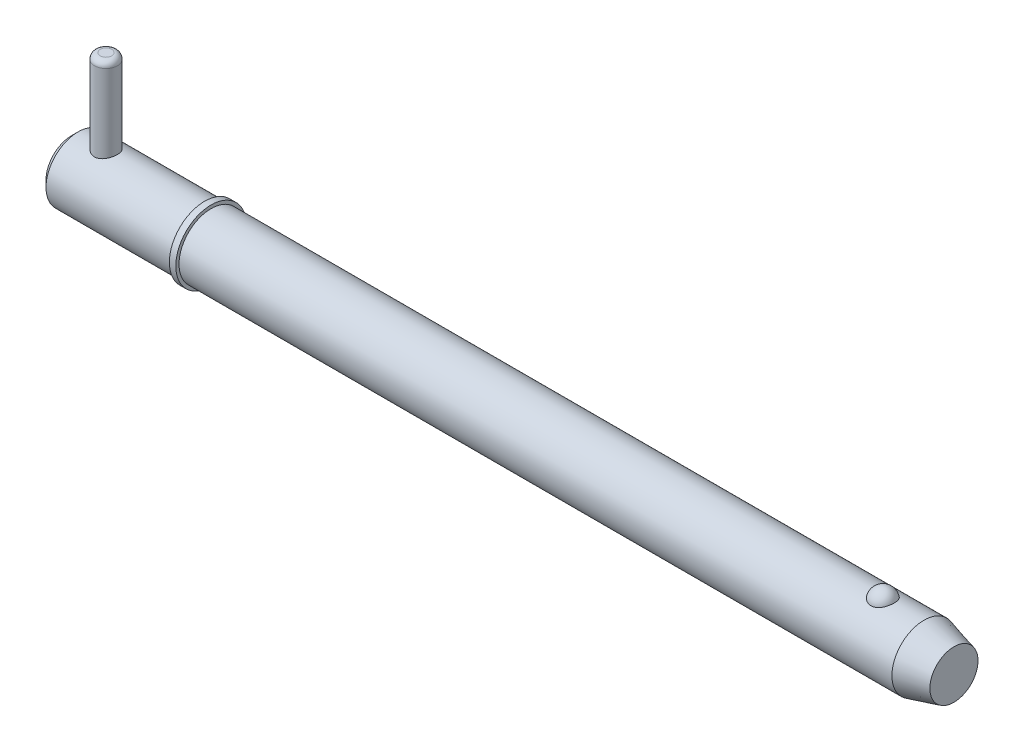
ISO-10303-21;
HEADER;
FILE_DESCRIPTION(('STEP AP214'),'2;1');
FILE_NAME('part.step','',(''),(''),'','','');
FILE_SCHEMA(('AUTOMOTIVE_DESIGN { 1 0 10303 214 1 1 1 1 }'));
ENDSEC;
DATA;
#1=APPLICATION_CONTEXT('core data for automotive mechanical design processes');
#2=APPLICATION_PROTOCOL_DEFINITION('international standard','automotive_design',2000,#1);
#3=PRODUCT_CONTEXT('',#1,'mechanical');
#4=PRODUCT('Part','Part','',(#3));
#5=PRODUCT_RELATED_PRODUCT_CATEGORY('part','',(#4));
#6=PRODUCT_DEFINITION_FORMATION('','',#4);
#7=PRODUCT_DEFINITION_CONTEXT('part definition',#1,'design');
#8=PRODUCT_DEFINITION('design','',#6,#7);
#9=PRODUCT_DEFINITION_SHAPE('','',#8);
#10=(LENGTH_UNIT() NAMED_UNIT(*) SI_UNIT(.MILLI.,.METRE.));
#11=(NAMED_UNIT(*) PLANE_ANGLE_UNIT() SI_UNIT($,.RADIAN.));
#12=(NAMED_UNIT(*) SI_UNIT($,.STERADIAN.) SOLID_ANGLE_UNIT());
#13=UNCERTAINTY_MEASURE_WITH_UNIT(LENGTH_MEASURE(1.E-05),#10,'distance_accuracy_value','');
#14=(GEOMETRIC_REPRESENTATION_CONTEXT(3) GLOBAL_UNCERTAINTY_ASSIGNED_CONTEXT((#13)) GLOBAL_UNIT_ASSIGNED_CONTEXT((#10,
#11,#12)) REPRESENTATION_CONTEXT('',''));
#15=CARTESIAN_POINT('',(0.,0.,0.));
#16=DIRECTION('',(0.,0.,1.));
#17=DIRECTION('',(1.,0.,0.));
#18=AXIS2_PLACEMENT_3D('',#15,#16,#17);
#19=CARTESIAN_POINT('',(5.94,19.845,0.));
#20=DIRECTION('',(0.,-1.,0.));
#21=DIRECTION('',(0.,0.,-1.));
#22=AXIS2_PLACEMENT_3D('',#19,#20,#21);
#23=CYLINDRICAL_SURFACE('',#22,1.98);
#24=CARTESIAN_POINT('',(5.94,-4.565,0.));
#25=DIRECTION('',(0.,1.,0.));
#26=DIRECTION('',(0.,0.,1.));
#27=AXIS2_PLACEMENT_3D('',#24,#25,#26);
#28=CIRCLE('',#27,1.98);
#29=CARTESIAN_POINT('',(5.94,-4.565,1.98));
#30=VERTEX_POINT('',#29);
#31=EDGE_CURVE('P0_E25',#30,#30,#28,.T.);
#32=ORIENTED_EDGE('',*,*,#31,.T.);
#33=EDGE_LOOP('',(#32));
#34=FACE_BOUND('',#33,.T.);
#35=CARTESIAN_POINT('',(5.94,18.855,0.));
#36=DIRECTION('',(0.,1.,0.));
#37=DIRECTION('',(0.,0.,1.));
#38=AXIS2_PLACEMENT_3D('',#35,#36,#37);
#39=CIRCLE('',#38,1.98);
#40=CARTESIAN_POINT('',(5.94,18.855,1.98));
#41=VERTEX_POINT('',#40);
#42=EDGE_CURVE('P0_E29',#41,#41,#39,.F.);
#43=ORIENTED_EDGE('',*,*,#42,.T.);
#44=EDGE_LOOP('',(#43));
#45=FACE_BOUND('',#44,.T.);
#46=ADVANCED_FACE('P0_F14',(#34,#45),#23,.T.);
#47=CARTESIAN_POINT('',(5.94,19.845,0.));
#48=DIRECTION('',(0.,1.,0.));
#49=DIRECTION('',(0.,0.,1.));
#50=AXIS2_PLACEMENT_3D('',#47,#48,#49);
#51=PLANE('',#50);
#52=CARTESIAN_POINT('',(5.94,19.845,0.));
#53=DIRECTION('',(0.,1.,0.));
#54=DIRECTION('',(0.,0.,1.));
#55=AXIS2_PLACEMENT_3D('',#52,#53,#54);
#56=CIRCLE('',#55,0.99);
#57=CARTESIAN_POINT('',(5.94,19.845,0.99));
#58=VERTEX_POINT('',#57);
#59=EDGE_CURVE('P0_E10',#58,#58,#56,.T.);
#60=ORIENTED_EDGE('',*,*,#59,.T.);
#61=EDGE_LOOP('',(#60));
#62=FACE_BOUND('',#61,.T.);
#63=ADVANCED_FACE('P0_F46',(#62),#51,.T.);
#64=CARTESIAN_POINT('',(5.94,-5.555,0.));
#65=DIRECTION('',(0.,1.,0.));
#66=DIRECTION('',(0.,0.,1.));
#67=AXIS2_PLACEMENT_3D('',#64,#65,#66);
#68=PLANE('',#67);
#69=CARTESIAN_POINT('',(5.94,-5.555,0.));
#70=DIRECTION('',(0.,1.,0.));
#71=DIRECTION('',(0.,0.,1.));
#72=AXIS2_PLACEMENT_3D('',#69,#70,#71);
#73=CIRCLE('',#72,0.99);
#74=CARTESIAN_POINT('',(5.94,-5.555,0.99));
#75=VERTEX_POINT('',#74);
#76=EDGE_CURVE('P0_E21',#75,#75,#73,.F.);
#77=ORIENTED_EDGE('',*,*,#76,.T.);
#78=EDGE_LOOP('',(#77));
#79=FACE_BOUND('',#78,.T.);
#80=ADVANCED_FACE('P0_F43',(#79),#68,.F.);
#81=CARTESIAN_POINT('',(5.94,-4.565,0.));
#82=DIRECTION('',(0.,1.,0.));
#83=DIRECTION('',(0.,0.,1.));
#84=AXIS2_PLACEMENT_3D('',#81,#82,#83);
#85=DEGENERATE_TOROIDAL_SURFACE('',#84,0.99,0.99,.T.);
#86=ORIENTED_EDGE('',*,*,#76,.F.);
#87=EDGE_LOOP('',(#86));
#88=FACE_BOUND('',#87,.T.);
#89=ORIENTED_EDGE('',*,*,#31,.F.);
#90=EDGE_LOOP('',(#89));
#91=FACE_BOUND('',#90,.T.);
#92=ADVANCED_FACE('P0_F38',(#88,#91),#85,.T.);
#93=CARTESIAN_POINT('',(5.94,18.855,0.));
#94=DIRECTION('',(0.,1.,0.));
#95=DIRECTION('',(0.,0.,1.));
#96=AXIS2_PLACEMENT_3D('',#93,#94,#95);
#97=DEGENERATE_TOROIDAL_SURFACE('',#96,0.99,0.99,.T.);
#98=ORIENTED_EDGE('',*,*,#42,.F.);
#99=EDGE_LOOP('',(#98));
#100=FACE_BOUND('',#99,.T.);
#101=ORIENTED_EDGE('',*,*,#59,.F.);
#102=EDGE_LOOP('',(#101));
#103=FACE_BOUND('',#102,.T.);
#104=ADVANCED_FACE('P0_F16',(#100,#103),#97,.T.);
#105=CLOSED_SHELL('',(#46,#63,#80,#92,#104));
#106=MANIFOLD_SOLID_BREP('P0_B1',#105);
#107=CARTESIAN_POINT('',(0.,0.,0.));
#108=DIRECTION('',(1.,0.,0.));
#109=DIRECTION('',(0.,0.,-1.));
#110=AXIS2_PLACEMENT_3D('',#107,#108,#109);
#111=CYLINDRICAL_SURFACE('',#110,5.555);
#112=CARTESIAN_POINT('',(147.517114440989,0.,0.));
#113=DIRECTION('',(1.,0.,0.));
#114=DIRECTION('',(0.,0.,-1.));
#115=AXIS2_PLACEMENT_3D('',#112,#113,#114);
#116=CIRCLE('',#115,5.555);
#117=CARTESIAN_POINT('',(147.517114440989,0.,-5.555));
#118=VERTEX_POINT('',#117);
#119=EDGE_CURVE('P1_E81',#118,#118,#116,.T.);
#120=ORIENTED_EDGE('',*,*,#119,.F.);
#121=EDGE_LOOP('',(#120));
#122=FACE_BOUND('',#121,.T.);
#123=CARTESIAN_POINT('',(24.13,0.,0.));
#124=DIRECTION('',(1.,0.,0.));
#125=DIRECTION('',(0.,0.,-1.));
#126=AXIS2_PLACEMENT_3D('',#123,#124,#125);
#127=CIRCLE('',#126,5.555);
#128=CARTESIAN_POINT('',(24.13,0.,-5.555));
#129=VERTEX_POINT('',#128);
#130=EDGE_CURVE('P1_E85',#129,#129,#127,.T.);
#131=ORIENTED_EDGE('',*,*,#130,.T.);
#132=EDGE_LOOP('',(#131));
#133=FACE_BOUND('',#132,.T.);
#134=CARTESIAN_POINT('',(140.398626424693,5.16741224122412,2.03859650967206));
#135=CARTESIAN_POINT('',(140.292949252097,5.16740893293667,2.03859990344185));
#136=CARTESIAN_POINT('',(140.18729894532,5.17079470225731,2.03008306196));
#137=CARTESIAN_POINT('',(139.979141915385,5.18392795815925,1.99630721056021));
#138=CARTESIAN_POINT('',(139.876634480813,5.19367399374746,1.97105201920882));
#139=CARTESIAN_POINT('',(139.677771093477,5.21839168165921,1.9046399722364));
#140=CARTESIAN_POINT('',(139.581406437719,5.23335573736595,1.8635062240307));
#141=CARTESIAN_POINT('',(139.397080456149,5.26688076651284,1.76652592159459));
#142=CARTESIAN_POINT('',(139.309120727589,5.28544242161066,1.71067657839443));
#143=CARTESIAN_POINT('',(139.141265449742,5.32479845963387,1.58399959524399));
#144=CARTESIAN_POINT('',(139.06166564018,5.34564089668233,1.51279545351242));
#145=CARTESIAN_POINT('',(138.91512901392,5.38697258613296,1.35828584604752));
#146=CARTESIAN_POINT('',(138.848194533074,5.40746177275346,1.27497815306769));
#147=CARTESIAN_POINT('',(138.72561039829,5.44694508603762,1.0944029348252));
#148=CARTESIAN_POINT('',(138.670598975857,5.46583143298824,0.996677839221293));
#149=CARTESIAN_POINT('',(138.576937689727,5.49908030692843,0.792961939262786));
#150=CARTESIAN_POINT('',(138.538289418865,5.513442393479,0.686970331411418));
#151=CARTESIAN_POINT('',(138.477680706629,5.53635851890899,0.468019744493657));
#152=CARTESIAN_POINT('',(138.455972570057,5.54482455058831,0.354981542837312));
#153=CARTESIAN_POINT('',(138.430636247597,5.55473324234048,0.12659586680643));
#154=CARTESIAN_POINT('',(138.427007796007,5.55617600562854,0.0112484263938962));
#155=CARTESIAN_POINT('',(138.437881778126,5.55189984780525,-0.218011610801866));
#156=CARTESIAN_POINT('',(138.452315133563,5.54620821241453,-0.331928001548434));
#157=CARTESIAN_POINT('',(138.498903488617,5.52828920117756,-0.555544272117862));
#158=CARTESIAN_POINT('',(138.531058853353,5.5160616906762,-0.665244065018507));
#159=CARTESIAN_POINT('',(138.612488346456,5.48630779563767,-0.877469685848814));
#160=CARTESIAN_POINT('',(138.661781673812,5.4687754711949,-0.979987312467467));
#161=CARTESIAN_POINT('',(138.776478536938,5.43024700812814,-1.17486975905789));
#162=CARTESIAN_POINT('',(138.841883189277,5.4092506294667,-1.26723387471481));
#163=CARTESIAN_POINT('',(138.987571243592,5.36600927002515,-1.4394013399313));
#164=CARTESIAN_POINT('',(139.067885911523,5.34376173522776,-1.51917763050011));
#165=CARTESIAN_POINT('',(139.241452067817,5.30057971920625,-1.66360338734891));
#166=CARTESIAN_POINT('',(139.334702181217,5.27964509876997,-1.72825445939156));
#167=CARTESIAN_POINT('',(139.529393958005,5.24205250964,-1.83909478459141));
#168=CARTESIAN_POINT('',(139.630590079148,5.22530519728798,-1.88568407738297));
#169=CARTESIAN_POINT('',(139.840155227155,5.1975091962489,-1.96100802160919));
#170=CARTESIAN_POINT('',(139.948521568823,5.1864583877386,-1.98974931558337));
#171=CARTESIAN_POINT('',(140.163498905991,5.17184410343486,-2.02742262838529));
#172=CARTESIAN_POINT('',(140.269925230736,5.1679328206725,-2.03727608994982));
#173=CARTESIAN_POINT('',(140.482992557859,5.16698995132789,-2.03966777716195));
#174=CARTESIAN_POINT('',(140.589633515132,5.16995704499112,-2.0322093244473));
#175=CARTESIAN_POINT('',(140.796773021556,5.18222383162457,-2.00071170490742));
#176=CARTESIAN_POINT('',(140.897359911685,5.19133213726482,-1.97717337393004));
#177=CARTESIAN_POINT('',(141.093014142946,5.21467637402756,-1.91475248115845));
#178=CARTESIAN_POINT('',(141.188081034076,5.22891272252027,-1.87586867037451));
#179=CARTESIAN_POINT('',(141.372371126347,5.26137066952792,-1.78282713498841));
#180=CARTESIAN_POINT('',(141.461419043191,5.27967329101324,-1.72835124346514));
#181=CARTESIAN_POINT('',(141.629288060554,5.3181741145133,-1.60597483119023));
#182=CARTESIAN_POINT('',(141.708106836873,5.33837274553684,-1.5380712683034));
#183=CARTESIAN_POINT('',(141.857515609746,5.37968287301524,-1.38688970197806));
#184=CARTESIAN_POINT('',(141.927505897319,5.40079011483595,-1.30301744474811));
#185=CARTESIAN_POINT('',(142.053012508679,5.44074401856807,-1.12458170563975));
#186=CARTESIAN_POINT('',(142.108526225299,5.45959027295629,-1.03001630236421));
#187=CARTESIAN_POINT('',(142.205550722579,5.49369849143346,-0.829439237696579));
#188=CARTESIAN_POINT('',(142.246548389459,5.50882422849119,-0.723155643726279));
#189=CARTESIAN_POINT('',(142.311125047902,5.53310911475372,-0.504772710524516));
#190=CARTESIAN_POINT('',(142.334703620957,5.54226812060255,-0.392673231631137));
#191=CARTESIAN_POINT('',(142.364013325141,5.55370358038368,-0.165459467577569));
#192=CARTESIAN_POINT('',(142.369688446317,5.55595843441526,-0.0503368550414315));
#193=CARTESIAN_POINT('',(142.362916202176,5.55329317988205,0.179288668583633));
#194=CARTESIAN_POINT('',(142.350469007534,5.54837313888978,0.293791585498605));
#195=CARTESIAN_POINT('',(142.307779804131,5.53189037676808,0.51852641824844));
#196=CARTESIAN_POINT('',(142.277598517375,5.5203503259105,0.62877154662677));
#197=CARTESIAN_POINT('',(142.200096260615,5.49182453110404,0.842318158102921));
#198=CARTESIAN_POINT('',(142.152774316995,5.47483847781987,0.94561924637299));
#199=CARTESIAN_POINT('',(142.041720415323,5.43710633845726,1.14281571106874));
#200=CARTESIAN_POINT('',(141.977921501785,5.41634501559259,1.23667048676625));
#201=CARTESIAN_POINT('',(141.835357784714,5.37334572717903,1.4118524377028));
#202=CARTESIAN_POINT('',(141.75659323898,5.35110778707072,1.49317982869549));
#203=CARTESIAN_POINT('',(141.586423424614,5.30779474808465,1.64049162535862));
#204=CARTESIAN_POINT('',(141.49510026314,5.2867132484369,1.70656877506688));
#205=CARTESIAN_POINT('',(141.301739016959,5.2480485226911,1.82201372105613));
#206=CARTESIAN_POINT('',(141.199700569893,5.23046541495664,1.87138095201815));
#207=CARTESIAN_POINT('',(140.983618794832,5.20042692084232,1.95335298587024));
#208=CARTESIAN_POINT('',(140.869260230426,5.18820192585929,1.98521734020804));
#209=CARTESIAN_POINT('',(140.636130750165,5.17169804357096,2.02783294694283));
#210=CARTESIAN_POINT('',(140.517361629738,5.16741595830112,2.03859269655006));
#211=CARTESIAN_POINT('',(140.398626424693,5.16741224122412,2.03859650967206));
#212=B_SPLINE_CURVE_WITH_KNOTS('',3,(#134,#135,#136,#137,#138,#139,#140,#141,#142,#143,#144,
#145,#146,#147,#148,#149,#150,#151,#152,#153,#154,#155,#156,#157,#158,#159,#160,#161,#162,#163,
#164,#165,#166,#167,#168,#169,#170,#171,#172,#173,#174,#175,#176,#177,#178,#179,#180,#181,#182,
#183,#184,#185,#186,#187,#188,#189,#190,#191,#192,#193,#194,#195,#196,#197,#198,#199,#200,#201,
#202,#203,#204,#205,#206,#207,#208,#209,#210,#211),.UNSPECIFIED.,.T.,.F.,(4,2,2,2,2,2,2,2,2,2,2,
2,2,2,2,2,2,2,2,2,2,2,2,2,2,2,2,2,2,2,2,2,2,2,2,2,2,2,4),(0.,0.316595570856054,
0.633118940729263,0.94918341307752,1.26530783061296,1.59030762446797,1.91536729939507,
2.25495824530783,2.59458224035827,2.93917283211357,3.28375835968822,3.62703002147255,
3.97030875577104,4.31397329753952,4.657661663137,5.00207904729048,5.34645984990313,
5.68270547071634,6.01882587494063,6.33808403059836,6.65728093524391,6.9669637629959,
7.27667180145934,7.59321535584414,7.90983070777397,8.24210387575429,8.57443684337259,
8.91755896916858,9.26068933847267,9.60489211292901,9.94909164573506,10.2921194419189,
10.6351667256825,10.9796305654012,11.3240884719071,11.6663928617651,12.0087088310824,
12.3645679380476,12.7202837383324),.UNSPECIFIED.);
#213=CARTESIAN_POINT('',(140.398626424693,5.16741224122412,2.03859650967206));
#214=VERTEX_POINT('',#213);
#215=EDGE_CURVE('P1_E35',#214,#214,#212,.T.);
#216=ORIENTED_EDGE('',*,*,#215,.T.);
#217=EDGE_LOOP('',(#216));
#218=FACE_BOUND('',#217,.T.);
#219=ADVANCED_FACE('P1_F13',(#122,#133,#218),#111,.T.);
#220=CARTESIAN_POINT('',(0.,0.,0.));
#221=DIRECTION('',(-1.,0.,0.));
#222=DIRECTION('',(0.,0.,1.));
#223=AXIS2_PLACEMENT_3D('',#220,#221,#222);
#224=PLANE('',#223);
#225=CARTESIAN_POINT('',(0.,0.,0.));
#226=DIRECTION('',(1.,0.,0.));
#227=DIRECTION('',(0.,0.,-1.));
#228=AXIS2_PLACEMENT_3D('',#225,#226,#227);
#229=CIRCLE('',#228,4.444);
#230=CARTESIAN_POINT('',(0.,0.,-4.444));
#231=VERTEX_POINT('',#230);
#232=EDGE_CURVE('P1_E9',#231,#231,#229,.T.);
#233=ORIENTED_EDGE('',*,*,#232,.F.);
#234=EDGE_LOOP('',(#233));
#235=FACE_BOUND('',#234,.T.);
#236=ADVANCED_FACE('P1_F15',(#235),#224,.T.);
#237=CARTESIAN_POINT('',(1.111,0.,0.));
#238=DIRECTION('',(1.,0.,0.));
#239=DIRECTION('',(0.,0.,-1.));
#240=AXIS2_PLACEMENT_3D('',#237,#238,#239);
#241=CONICAL_SURFACE('',#240,5.555,0.78539816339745);
#242=ORIENTED_EDGE('',*,*,#232,.T.);
#243=EDGE_LOOP('',(#242));
#244=FACE_BOUND('',#243,.T.);
#245=CARTESIAN_POINT('',(1.111,0.,0.));
#246=DIRECTION('',(1.,0.,0.));
#247=DIRECTION('',(0.,0.,-1.));
#248=AXIS2_PLACEMENT_3D('',#245,#246,#247);
#249=CIRCLE('',#248,5.555);
#250=CARTESIAN_POINT('',(1.111,0.,-5.555));
#251=VERTEX_POINT('',#250);
#252=EDGE_CURVE('P1_E26',#251,#251,#249,.T.);
#253=ORIENTED_EDGE('',*,*,#252,.F.);
#254=EDGE_LOOP('',(#253));
#255=FACE_BOUND('',#254,.T.);
#256=ADVANCED_FACE('P1_F77',(#244,#255),#241,.T.);
#257=CARTESIAN_POINT('',(0.,0.,0.));
#258=DIRECTION('',(1.,0.,0.));
#259=DIRECTION('',(0.,0.,-1.));
#260=AXIS2_PLACEMENT_3D('',#257,#258,#259);
#261=CYLINDRICAL_SURFACE('',#260,5.555);
#262=CARTESIAN_POINT('',(5.94,-5.19014691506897,1.98));
#263=CARTESIAN_POINT('',(5.83264687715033,-5.19014494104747,1.98000226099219));
#264=CARTESIAN_POINT('',(5.7253094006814,-5.19351395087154,1.97123988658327));
#265=CARTESIAN_POINT('',(5.51384517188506,-5.20654291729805,1.93656219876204));
#266=CARTESIAN_POINT('',(5.40971858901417,-5.21620320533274,1.91064598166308));
#267=CARTESIAN_POINT('',(5.20778082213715,-5.24058443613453,1.84271148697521));
#268=CARTESIAN_POINT('',(5.10995634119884,-5.25529427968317,1.80072850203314));
#269=CARTESIAN_POINT('',(4.92270352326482,-5.28810012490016,1.70197537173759));
#270=CARTESIAN_POINT('',(4.83327743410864,-5.3061970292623,1.64520128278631));
#271=CARTESIAN_POINT('',(4.66135184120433,-5.34464714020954,1.51575187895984));
#272=CARTESIAN_POINT('',(4.57928277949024,-5.36506222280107,1.44252311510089));
#273=CARTESIAN_POINT('',(4.42829115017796,-5.40532920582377,1.28342047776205));
#274=CARTESIAN_POINT('',(4.35937105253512,-5.42518099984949,1.19754423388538));
#275=CARTESIAN_POINT('',(4.23461605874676,-5.46281133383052,1.01237205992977));
#276=CARTESIAN_POINT('',(4.17924129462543,-5.48050875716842,0.912748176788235));
#277=CARTESIAN_POINT('',(4.0862117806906,-5.51109938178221,0.70485824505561));
#278=CARTESIAN_POINT('',(4.0485515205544,-5.52399407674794,0.596594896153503));
#279=CARTESIAN_POINT('',(3.99350662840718,-5.54308759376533,0.379019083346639));
#280=CARTESIAN_POINT('',(3.97538263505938,-5.54952987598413,0.269915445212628));
#281=CARTESIAN_POINT('',(3.95756405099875,-5.55586205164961,0.0500378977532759));
#282=CARTESIAN_POINT('',(3.95786404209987,-5.55575387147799,-0.060735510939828));
#283=CARTESIAN_POINT('',(3.97643665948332,-5.54915684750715,-0.275539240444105));
#284=CARTESIAN_POINT('',(3.99390415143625,-5.54295384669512,-0.379649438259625));
#285=CARTESIAN_POINT('',(4.0449721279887,-5.52523170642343,-0.583350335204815));
#286=CARTESIAN_POINT('',(4.07857373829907,-5.51371219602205,-0.682940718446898));
#287=CARTESIAN_POINT('',(4.16137312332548,-5.4863099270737,-0.876423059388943));
#288=CARTESIAN_POINT('',(4.2107826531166,-5.47036834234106,-0.970215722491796));
#289=CARTESIAN_POINT('',(4.32361427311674,-5.43575653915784,-1.1484017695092));
#290=CARTESIAN_POINT('',(4.38704062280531,-5.41708549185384,-1.23279228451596));
#291=CARTESIAN_POINT('',(4.53006791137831,-5.37778429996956,-1.39454579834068));
#292=CARTESIAN_POINT('',(4.61035105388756,-5.35710277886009,-1.4712940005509));
#293=CARTESIAN_POINT('',(4.78279835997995,-5.31692766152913,-1.6104545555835));
#294=CARTESIAN_POINT('',(4.874964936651,-5.29743430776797,-1.67286398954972));
#295=CARTESIAN_POINT('',(5.07076688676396,-5.26153775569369,-1.78259698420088));
#296=CARTESIAN_POINT('',(5.17458163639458,-5.24519780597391,-1.8296227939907));
#297=CARTESIAN_POINT('',(5.38938990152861,-5.21818744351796,-1.90530278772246));
#298=CARTESIAN_POINT('',(5.50037985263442,-5.20751423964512,-1.93396601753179));
#299=CARTESIAN_POINT('',(5.72036376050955,-5.19369176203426,-1.97077654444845));
#300=CARTESIAN_POINT('',(5.82917370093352,-5.19018851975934,-1.97989015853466));
#301=CARTESIAN_POINT('',(6.04680100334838,-5.19010609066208,-1.98010779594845));
#302=CARTESIAN_POINT('',(6.15561835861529,-5.19352540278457,-1.97121572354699));
#303=CARTESIAN_POINT('',(6.36548036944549,-5.20654623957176,-1.93654727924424));
#304=CARTESIAN_POINT('',(6.46666051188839,-5.21588705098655,-1.91148218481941));
#305=CARTESIAN_POINT('',(6.66334537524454,-5.23939939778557,-1.84605494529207));
#306=CARTESIAN_POINT('',(6.75884899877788,-5.25357186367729,-1.8056898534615));
#307=CARTESIAN_POINT('',(6.94517989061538,-5.28576258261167,-1.70921153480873));
#308=CARTESIAN_POINT('',(7.03572661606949,-5.30389804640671,-1.65259670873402));
#309=CARTESIAN_POINT('',(7.20638087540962,-5.34176077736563,-1.52577523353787));
#310=CARTESIAN_POINT('',(7.28648490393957,-5.36148857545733,-1.45556404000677));
#311=CARTESIAN_POINT('',(7.43864697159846,-5.40165494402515,-1.2988614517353));
#312=CARTESIAN_POINT('',(7.50999887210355,-5.42207106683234,-1.21167640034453));
#313=CARTESIAN_POINT('',(7.63712639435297,-5.46023601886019,-1.026066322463));
#314=CARTESIAN_POINT('',(7.69290228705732,-5.47798489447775,-0.927641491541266));
#315=CARTESIAN_POINT('',(7.78684673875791,-5.50876590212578,-0.722633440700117));
#316=CARTESIAN_POINT('',(7.82510508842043,-5.52182201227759,-0.616095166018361));
#317=CARTESIAN_POINT('',(7.88297051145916,-5.54184206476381,-0.397530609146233));
#318=CARTESIAN_POINT('',(7.90258540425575,-5.5488085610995,-0.285506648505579));
#319=CARTESIAN_POINT('',(7.9218262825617,-5.55564472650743,-0.065566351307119));
#320=CARTESIAN_POINT('',(7.92245987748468,-5.55587212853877,0.0422515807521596));
#321=CARTESIAN_POINT('',(7.90626329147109,-5.55011340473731,0.256387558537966));
#322=CARTESIAN_POINT('',(7.88943488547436,-5.54412791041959,0.362705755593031));
#323=CARTESIAN_POINT('',(7.83948457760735,-5.52676548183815,0.568649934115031));
#324=CARTESIAN_POINT('',(7.8067003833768,-5.51550046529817,0.668367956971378));
#325=CARTESIAN_POINT('',(7.72609369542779,-5.48874437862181,0.860911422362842));
#326=CARTESIAN_POINT('',(7.67826838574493,-5.47325251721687,0.953735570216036));
#327=CARTESIAN_POINT('',(7.56675024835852,-5.43884382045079,1.13391068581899));
#328=CARTESIAN_POINT('',(7.50249968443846,-5.41981485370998,1.22089468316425));
#329=CARTESIAN_POINT('',(7.36086495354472,-5.38069275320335,1.38316665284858));
#330=CARTESIAN_POINT('',(7.28347630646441,-5.36059925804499,1.45845061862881));
#331=CARTESIAN_POINT('',(7.11347587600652,-5.32048380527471,1.59876646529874));
#332=CARTESIAN_POINT('',(7.02032386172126,-5.30050854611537,1.66315951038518));
#333=CARTESIAN_POINT('',(6.82388804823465,-5.26398994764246,1.77536801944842));
#334=CARTESIAN_POINT('',(6.7206049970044,-5.24744635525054,1.82318470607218));
#335=CARTESIAN_POINT('',(6.50639706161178,-5.21987969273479,1.90068230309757));
#336=CARTESIAN_POINT('',(6.3954529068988,-5.20887116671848,1.93031547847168));
#337=CARTESIAN_POINT('',(6.16966522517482,-5.19400760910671,1.96996824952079));
#338=CARTESIAN_POINT('',(6.05482366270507,-5.19014902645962,1.97999758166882));
#339=CARTESIAN_POINT('',(5.94,-5.19014691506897,1.98));
#340=B_SPLINE_CURVE_WITH_KNOTS('',3,(#262,#263,#264,#265,#266,#267,#268,#269,#270,#271,#272,
#273,#274,#275,#276,#277,#278,#279,#280,#281,#282,#283,#284,#285,#286,#287,#288,#289,#290,#291,
#292,#293,#294,#295,#296,#297,#298,#299,#300,#301,#302,#303,#304,#305,#306,#307,#308,#309,#310,
#311,#312,#313,#314,#315,#316,#317,#318,#319,#320,#321,#322,#323,#324,#325,#326,#327,#328,#329,
#330,#331,#332,#333,#334,#335,#336,#337,#338,#339),.UNSPECIFIED.,.T.,.F.,(4,2,2,2,2,2,2,2,2,2,2,
2,2,2,2,2,2,2,2,2,2,2,2,2,2,2,2,2,2,2,2,2,2,2,2,2,2,2,4),(0.,0.321632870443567,
0.643282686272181,0.964229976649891,1.28526292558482,1.61937087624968,1.9535415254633,
2.29784481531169,2.64204093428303,2.97269632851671,3.30325448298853,3.61901541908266,
3.93479838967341,4.25500220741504,4.57530346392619,4.91268648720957,5.25013812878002,
5.59378026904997,5.93725299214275,6.26331481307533,6.58930593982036,6.90185604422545,
7.21446637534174,7.53801472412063,7.86167140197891,8.20353561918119,8.54539388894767,
8.88547970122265,9.22542281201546,9.54728637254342,9.86911722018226,10.1844146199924,
10.4997710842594,10.827730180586,11.1558013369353,11.499115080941,11.8424034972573,
12.1865892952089,12.5306041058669),.UNSPECIFIED.);
#341=CARTESIAN_POINT('',(5.94,-5.19014691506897,1.98));
#342=VERTEX_POINT('',#341);
#343=EDGE_CURVE('P1_E17',#342,#342,#340,.T.);
#344=ORIENTED_EDGE('',*,*,#343,.F.);
#345=EDGE_LOOP('',(#344));
#346=FACE_BOUND('',#345,.T.);
#347=CARTESIAN_POINT('',(5.94,5.19014691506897,1.98));
#348=CARTESIAN_POINT('',(6.04735312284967,5.19014494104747,1.98000226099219));
#349=CARTESIAN_POINT('',(6.1546905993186,5.19351395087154,1.97123988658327));
#350=CARTESIAN_POINT('',(6.36615482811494,5.20654291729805,1.93656219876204));
#351=CARTESIAN_POINT('',(6.47028141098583,5.21620320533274,1.91064598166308));
#352=CARTESIAN_POINT('',(6.67221917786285,5.24058443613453,1.84271148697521));
#353=CARTESIAN_POINT('',(6.77004365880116,5.25529427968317,1.80072850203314));
#354=CARTESIAN_POINT('',(6.95729647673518,5.28810012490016,1.70197537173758));
#355=CARTESIAN_POINT('',(7.04672256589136,5.3061970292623,1.64520128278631));
#356=CARTESIAN_POINT('',(7.21864815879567,5.34464714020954,1.51575187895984));
#357=CARTESIAN_POINT('',(7.30071722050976,5.36506222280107,1.44252311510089));
#358=CARTESIAN_POINT('',(7.45170884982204,5.40532920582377,1.28342047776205));
#359=CARTESIAN_POINT('',(7.52062894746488,5.42518099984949,1.19754423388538));
#360=CARTESIAN_POINT('',(7.64538394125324,5.46281133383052,1.01237205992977));
#361=CARTESIAN_POINT('',(7.70075870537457,5.48050875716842,0.912748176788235));
#362=CARTESIAN_POINT('',(7.7937882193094,5.51109938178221,0.704858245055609));
#363=CARTESIAN_POINT('',(7.8314484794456,5.52399407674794,0.596594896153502));
#364=CARTESIAN_POINT('',(7.88649337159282,5.54308759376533,0.379019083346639));
#365=CARTESIAN_POINT('',(7.90461736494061,5.54952987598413,0.269915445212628));
#366=CARTESIAN_POINT('',(7.92243594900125,5.55586205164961,0.0500378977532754));
#367=CARTESIAN_POINT('',(7.92213595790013,5.55575387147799,-0.0607355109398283));
#368=CARTESIAN_POINT('',(7.90356334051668,5.54915684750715,-0.275539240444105));
#369=CARTESIAN_POINT('',(7.88609584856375,5.54295384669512,-0.379649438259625));
#370=CARTESIAN_POINT('',(7.8350278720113,5.52523170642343,-0.583350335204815));
#371=CARTESIAN_POINT('',(7.80142626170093,5.51371219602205,-0.682940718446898));
#372=CARTESIAN_POINT('',(7.71862687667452,5.4863099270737,-0.876423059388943));
#373=CARTESIAN_POINT('',(7.6692173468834,5.47036834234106,-0.970215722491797));
#374=CARTESIAN_POINT('',(7.55638572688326,5.43575653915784,-1.1484017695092));
#375=CARTESIAN_POINT('',(7.49295937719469,5.41708549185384,-1.23279228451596));
#376=CARTESIAN_POINT('',(7.34993208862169,5.37778429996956,-1.39454579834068));
#377=CARTESIAN_POINT('',(7.26964894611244,5.35710277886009,-1.4712940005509));
#378=CARTESIAN_POINT('',(7.09720164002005,5.31692766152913,-1.6104545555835));
#379=CARTESIAN_POINT('',(7.00503506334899,5.29743430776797,-1.67286398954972));
#380=CARTESIAN_POINT('',(6.80923311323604,5.26153775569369,-1.78259698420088));
#381=CARTESIAN_POINT('',(6.70541836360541,5.24519780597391,-1.8296227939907));
#382=CARTESIAN_POINT('',(6.49061009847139,5.21818744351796,-1.90530278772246));
#383=CARTESIAN_POINT('',(6.37962014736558,5.20751423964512,-1.93396601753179));
#384=CARTESIAN_POINT('',(6.15963623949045,5.19369176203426,-1.97077654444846));
#385=CARTESIAN_POINT('',(6.05082629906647,5.19018851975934,-1.97989015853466));
#386=CARTESIAN_POINT('',(5.83319899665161,5.19010609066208,-1.98010779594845));
#387=CARTESIAN_POINT('',(5.7243816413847,5.19352540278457,-1.97121572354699));
#388=CARTESIAN_POINT('',(5.5145196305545,5.20654623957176,-1.93654727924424));
#389=CARTESIAN_POINT('',(5.4133394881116,5.21588705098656,-1.91148218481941));
#390=CARTESIAN_POINT('',(5.21665462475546,5.23939939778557,-1.84605494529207));
#391=CARTESIAN_POINT('',(5.12115100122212,5.25357186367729,-1.8056898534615));
#392=CARTESIAN_POINT('',(4.93482010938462,5.28576258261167,-1.70921153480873));
#393=CARTESIAN_POINT('',(4.84427338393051,5.30389804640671,-1.65259670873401));
#394=CARTESIAN_POINT('',(4.67361912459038,5.34176077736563,-1.52577523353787));
#395=CARTESIAN_POINT('',(4.59351509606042,5.36148857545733,-1.45556404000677));
#396=CARTESIAN_POINT('',(4.44135302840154,5.40165494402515,-1.2988614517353));
#397=CARTESIAN_POINT('',(4.37000112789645,5.42207106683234,-1.21167640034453));
#398=CARTESIAN_POINT('',(4.24287360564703,5.46023601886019,-1.026066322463));
#399=CARTESIAN_POINT('',(4.18709771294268,5.47798489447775,-0.927641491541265));
#400=CARTESIAN_POINT('',(4.09315326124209,5.50876590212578,-0.722633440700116));
#401=CARTESIAN_POINT('',(4.05489491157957,5.52182201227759,-0.61609516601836));
#402=CARTESIAN_POINT('',(3.99702948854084,5.54184206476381,-0.397530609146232));
#403=CARTESIAN_POINT('',(3.97741459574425,5.5488085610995,-0.285506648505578));
#404=CARTESIAN_POINT('',(3.9581737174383,5.55564472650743,-0.0655663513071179));
#405=CARTESIAN_POINT('',(3.95754012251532,5.55587212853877,0.0422515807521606));
#406=CARTESIAN_POINT('',(3.97373670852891,5.55011340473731,0.256387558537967));
#407=CARTESIAN_POINT('',(3.99056511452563,5.54412791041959,0.362705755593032));
#408=CARTESIAN_POINT('',(4.04051542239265,5.52676548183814,0.568649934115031));
#409=CARTESIAN_POINT('',(4.07329961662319,5.51550046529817,0.668367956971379));
#410=CARTESIAN_POINT('',(4.15390630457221,5.48874437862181,0.860911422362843));
#411=CARTESIAN_POINT('',(4.20173161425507,5.47325251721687,0.953735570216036));
#412=CARTESIAN_POINT('',(4.31324975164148,5.43884382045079,1.13391068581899));
#413=CARTESIAN_POINT('',(4.37750031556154,5.41981485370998,1.22089468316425));
#414=CARTESIAN_POINT('',(4.51913504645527,5.38069275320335,1.38316665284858));
#415=CARTESIAN_POINT('',(4.59652369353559,5.36059925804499,1.45845061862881));
#416=CARTESIAN_POINT('',(4.76652412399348,5.32048380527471,1.59876646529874));
#417=CARTESIAN_POINT('',(4.85967613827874,5.30050854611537,1.66315951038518));
#418=CARTESIAN_POINT('',(5.05611195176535,5.26398994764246,1.77536801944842));
#419=CARTESIAN_POINT('',(5.1593950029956,5.24744635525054,1.82318470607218));
#420=CARTESIAN_POINT('',(5.37360293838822,5.21987969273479,1.90068230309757));
#421=CARTESIAN_POINT('',(5.4845470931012,5.20887116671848,1.93031547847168));
#422=CARTESIAN_POINT('',(5.71033477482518,5.19400760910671,1.96996824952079));
#423=CARTESIAN_POINT('',(5.82517633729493,5.19014902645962,1.97999758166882));
#424=CARTESIAN_POINT('',(5.94,5.19014691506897,1.98));
#425=B_SPLINE_CURVE_WITH_KNOTS('',3,(#347,#348,#349,#350,#351,#352,#353,#354,#355,#356,#357,
#358,#359,#360,#361,#362,#363,#364,#365,#366,#367,#368,#369,#370,#371,#372,#373,#374,#375,#376,
#377,#378,#379,#380,#381,#382,#383,#384,#385,#386,#387,#388,#389,#390,#391,#392,#393,#394,#395,
#396,#397,#398,#399,#400,#401,#402,#403,#404,#405,#406,#407,#408,#409,#410,#411,#412,#413,#414,
#415,#416,#417,#418,#419,#420,#421,#422,#423,#424),.UNSPECIFIED.,.T.,.F.,(4,2,2,2,2,2,2,2,2,2,2,
2,2,2,2,2,2,2,2,2,2,2,2,2,2,2,2,2,2,2,2,2,2,2,2,2,2,2,4),(0.,0.321632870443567,
0.643282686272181,0.964229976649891,1.28526292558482,1.61937087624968,1.9535415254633,
2.29784481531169,2.64204093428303,2.97269632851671,3.30325448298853,3.61901541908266,
3.93479838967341,4.25500220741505,4.57530346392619,4.91268648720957,5.25013812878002,
5.59378026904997,5.93725299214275,6.26331481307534,6.58930593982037,6.90185604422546,
7.21446637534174,7.53801472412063,7.86167140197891,8.20353561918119,8.54539388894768,
8.88547970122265,9.22542281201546,9.54728637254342,9.86911722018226,10.1844146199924,
10.4997710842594,10.827730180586,11.1558013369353,11.499115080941,11.8424034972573,
12.1865892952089,12.5306041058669),.UNSPECIFIED.);
#426=CARTESIAN_POINT('',(5.94,5.19014691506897,1.98));
#427=VERTEX_POINT('',#426);
#428=EDGE_CURVE('P1_E43',#427,#427,#425,.T.);
#429=ORIENTED_EDGE('',*,*,#428,.F.);
#430=EDGE_LOOP('',(#429));
#431=FACE_BOUND('',#430,.T.);
#432=ORIENTED_EDGE('',*,*,#252,.T.);
#433=EDGE_LOOP('',(#432));
#434=FACE_BOUND('',#433,.T.);
#435=CARTESIAN_POINT('',(23.019,0.,0.));
#436=DIRECTION('',(1.,0.,0.));
#437=DIRECTION('',(0.,0.,-1.));
#438=AXIS2_PLACEMENT_3D('',#435,#436,#437);
#439=CIRCLE('',#438,5.555);
#440=CARTESIAN_POINT('',(23.019,0.,-5.555));
#441=VERTEX_POINT('',#440);
#442=EDGE_CURVE('P1_E31',#441,#441,#439,.T.);
#443=ORIENTED_EDGE('',*,*,#442,.F.);
#444=EDGE_LOOP('',(#443));
#445=FACE_BOUND('',#444,.T.);
#446=ADVANCED_FACE('P1_F103',(#346,#431,#434,#445),#261,.T.);
#447=CARTESIAN_POINT('',(23.019,5.555,0.));
#448=DIRECTION('',(-1.,0.,0.));
#449=DIRECTION('',(0.,0.,1.));
#450=AXIS2_PLACEMENT_3D('',#447,#448,#449);
#451=PLANE('',#450);
#452=ORIENTED_EDGE('',*,*,#442,.T.);
#453=EDGE_LOOP('',(#452));
#454=FACE_BOUND('',#453,.T.);
#455=CARTESIAN_POINT('',(23.019,0.,0.));
#456=DIRECTION('',(1.,0.,0.));
#457=DIRECTION('',(0.,0.,-1.));
#458=AXIS2_PLACEMENT_3D('',#455,#456,#457);
#459=CIRCLE('',#458,6.1105);
#460=CARTESIAN_POINT('',(23.019,0.,-6.1105));
#461=VERTEX_POINT('',#460);
#462=EDGE_CURVE('P1_E91',#461,#461,#459,.T.);
#463=ORIENTED_EDGE('',*,*,#462,.F.);
#464=EDGE_LOOP('',(#463));
#465=FACE_BOUND('',#464,.T.);
#466=ADVANCED_FACE('P1_F100',(#454,#465),#451,.T.);
#467=CARTESIAN_POINT('',(0.,0.,0.));
#468=DIRECTION('',(1.,0.,0.));
#469=DIRECTION('',(0.,0.,-1.));
#470=AXIS2_PLACEMENT_3D('',#467,#468,#469);
#471=CYLINDRICAL_SURFACE('',#470,6.1105);
#472=ORIENTED_EDGE('',*,*,#462,.T.);
#473=EDGE_LOOP('',(#472));
#474=FACE_BOUND('',#473,.T.);
#475=CARTESIAN_POINT('',(24.13,0.,0.));
#476=DIRECTION('',(1.,0.,0.));
#477=DIRECTION('',(0.,0.,-1.));
#478=AXIS2_PLACEMENT_3D('',#475,#476,#477);
#479=CIRCLE('',#478,6.1105);
#480=CARTESIAN_POINT('',(24.13,0.,-6.1105));
#481=VERTEX_POINT('',#480);
#482=EDGE_CURVE('P1_E88',#481,#481,#479,.T.);
#483=ORIENTED_EDGE('',*,*,#482,.F.);
#484=EDGE_LOOP('',(#483));
#485=FACE_BOUND('',#484,.T.);
#486=ADVANCED_FACE('P1_F68',(#474,#485),#471,.T.);
#487=CARTESIAN_POINT('',(24.13,6.1105,0.));
#488=DIRECTION('',(1.,0.,0.));
#489=DIRECTION('',(0.,0.,-1.));
#490=AXIS2_PLACEMENT_3D('',#487,#488,#489);
#491=PLANE('',#490);
#492=ORIENTED_EDGE('',*,*,#482,.T.);
#493=EDGE_LOOP('',(#492));
#494=FACE_BOUND('',#493,.T.);
#495=ORIENTED_EDGE('',*,*,#130,.F.);
#496=EDGE_LOOP('',(#495));
#497=FACE_BOUND('',#496,.T.);
#498=ADVANCED_FACE('P1_F62',(#494,#497),#491,.T.);
#499=CARTESIAN_POINT('',(152.7,0.,0.));
#500=DIRECTION('',(-1.,0.,0.));
#501=DIRECTION('',(0.,0.,1.));
#502=AXIS2_PLACEMENT_3D('',#499,#500,#501);
#503=CONICAL_SURFACE('',#502,4.16625000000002,0.261799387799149);
#504=ORIENTED_EDGE('',*,*,#119,.T.);
#505=EDGE_LOOP('',(#504));
#506=FACE_BOUND('',#505,.T.);
#507=CARTESIAN_POINT('',(152.7,0.,0.));
#508=DIRECTION('',(1.,0.,0.));
#509=DIRECTION('',(0.,0.,-1.));
#510=AXIS2_PLACEMENT_3D('',#507,#508,#509);
#511=CIRCLE('',#510,4.16625000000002);
#512=CARTESIAN_POINT('',(152.7,0.,-4.16625000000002));
#513=VERTEX_POINT('',#512);
#514=EDGE_CURVE('P1_E42',#513,#513,#511,.T.);
#515=ORIENTED_EDGE('',*,*,#514,.F.);
#516=EDGE_LOOP('',(#515));
#517=FACE_BOUND('',#516,.T.);
#518=ADVANCED_FACE('P1_F59',(#506,#517),#503,.T.);
#519=CARTESIAN_POINT('',(152.7,4.16625000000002,0.));
#520=DIRECTION('',(1.,0.,0.));
#521=DIRECTION('',(0.,0.,-1.));
#522=AXIS2_PLACEMENT_3D('',#519,#520,#521);
#523=PLANE('',#522);
#524=ORIENTED_EDGE('',*,*,#514,.T.);
#525=EDGE_LOOP('',(#524));
#526=FACE_BOUND('',#525,.T.);
#527=ADVANCED_FACE('P1_F55',(#526),#523,.T.);
#528=CARTESIAN_POINT('',(140.398626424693,4.9995,0.));
#529=DIRECTION('',(-1.,0.,0.));
#530=DIRECTION('',(0.,1.,0.));
#531=AXIS2_PLACEMENT_3D('',#528,#529,#530);
#532=SPHERICAL_SURFACE('',#531,2.04550000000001);
#533=ORIENTED_EDGE('',*,*,#215,.F.);
#534=EDGE_LOOP('',(#533));
#535=FACE_BOUND('',#534,.T.);
#536=ADVANCED_FACE('P1_F50',(#535),#532,.T.);
#537=CARTESIAN_POINT('',(5.94,-6.1105,0.));
#538=DIRECTION('',(0.,1.,0.));
#539=DIRECTION('',(0.,0.,1.));
#540=AXIS2_PLACEMENT_3D('',#537,#538,#539);
#541=CYLINDRICAL_SURFACE('',#540,1.98);
#542=ORIENTED_EDGE('',*,*,#343,.T.);
#543=EDGE_LOOP('',(#542));
#544=FACE_BOUND('',#543,.T.);
#545=ORIENTED_EDGE('',*,*,#428,.T.);
#546=EDGE_LOOP('',(#545));
#547=FACE_BOUND('',#546,.T.);
#548=ADVANCED_FACE('P1_F54',(#544,#547),#541,.F.);
#549=CLOSED_SHELL('',(#219,#236,#256,#446,#466,#486,#498,#518,#527,#536,#548));
#550=MANIFOLD_SOLID_BREP('P1_B1',#549);
#551=ADVANCED_BREP_SHAPE_REPRESENTATION('',(#18,#106,#550),#14);
#552=SHAPE_DEFINITION_REPRESENTATION(#9,#551);
ENDSEC;
END-ISO-10303-21;
